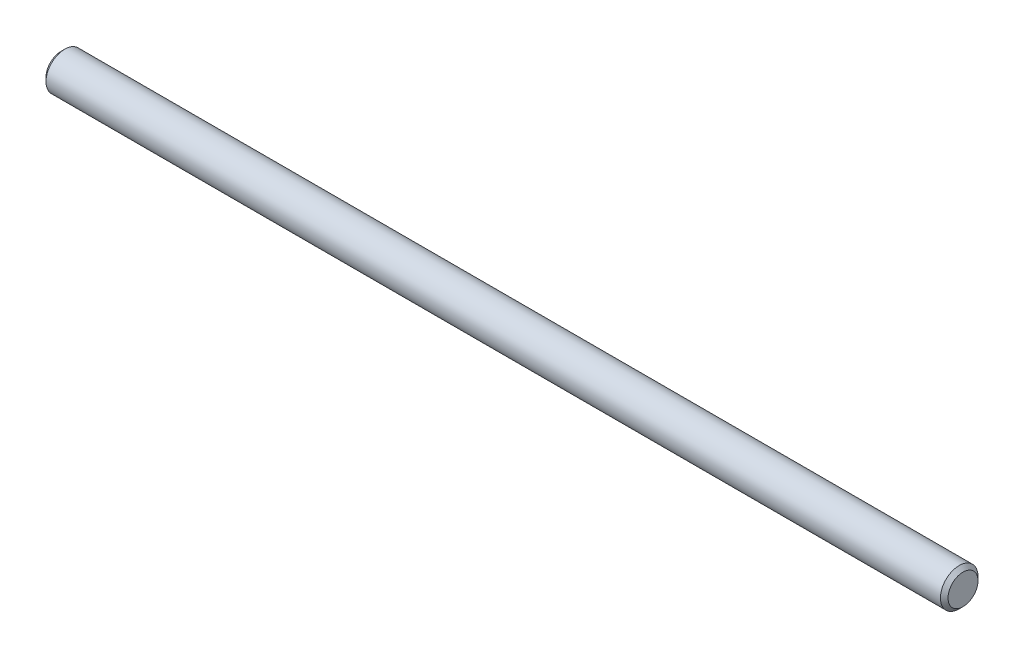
from build123d import *

# Parameters (mm, degrees)
SKETCH1_R           = 4
BOSS_EXTRUDE1_DEPTH = 96
CHAMFER1_SIZE       = 0.81


with BuildPart() as part:
    # Sketch1 → Boss-Extrude1 (new, symmetric)
    with BuildSketch(Plane(origin=(0, 0, 0), x_dir=(0, 0, -1), z_dir=(1, 0, 0))):
        Circle(SKETCH1_R)
    extrude(amount=BOSS_EXTRUDE1_DEPTH, both=True)

    # Chamfer1
    chamfer1_edges = [part.edges().sort_by_distance(p)[0] for p in [
        (-96, 0, 4),
        (96, 0, 4),
    ]]
    chamfer(chamfer1_edges, length=CHAMFER1_SIZE)


solid = part.part
